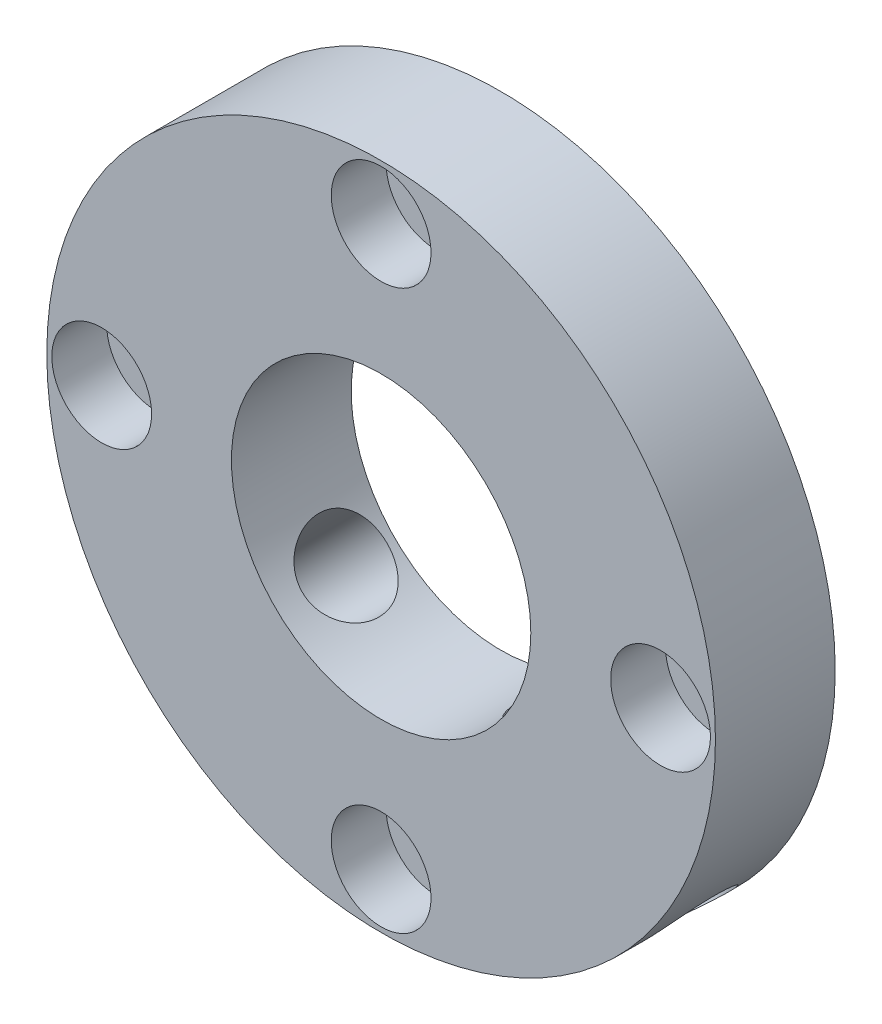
from build123d import *

# Parameters (mm, degrees)
SKETCH1_R                               = 33.5
SKETCH1_R_2                             = 15
BOSS_EXTRUDE1_DEPTH                     = 12
CBORE_FOR_M5_HEX_HEAD_BOLT1_D           = 5.5
CBORE_FOR_M5_HEX_HEAD_BOLT1_CBORE_D     = 10
CBORE_FOR_M5_HEX_HEAD_BOLT1_CBORE_DEPTH = 5.5
CIRPATTERN1_COUNT                       = 4
F_8_0MM_DOWEL_HOLE1_REACH               = 83.174
F_8_0MM_DOWEL_HOLE1_BORE_R              = 4.25
CIRPATTERN2_COUNT                       = 2
CIRPATTERN2_ANGLE                       = 90


with BuildPart() as part:
    # Sketch1 → Boss-Extrude1 (new body)
    with BuildSketch(Plane.XY):
        Circle(SKETCH1_R)
        Circle(SKETCH1_R_2, mode=Mode.SUBTRACT)
    extrude(amount=BOSS_EXTRUDE1_DEPTH)

    # CBORE for M5 Hex Head Bolt1 (through all)
    with Locations(Plane(origin=(0, 28, 12), x_dir=(1, 0, 0), z_dir=(0, 0, 1))):
        with Locations((0, 0)):
            cbore_for_m5_hex_head_bolt1 = CounterBoreHole(CBORE_FOR_M5_HEX_HEAD_BOLT1_D / 2, CBORE_FOR_M5_HEX_HEAD_BOLT1_CBORE_D / 2, CBORE_FOR_M5_HEX_HEAD_BOLT1_CBORE_DEPTH)

    # CirPattern1: CBORE for M5 Hex Head Bolt1 ×4 about axis
    cirpattern1_axis = Axis((0, 0, 0), (0, 0, 1))
    for i in range(1, CIRPATTERN1_COUNT):
        add(cbore_for_m5_hex_head_bolt1.rotate(cirpattern1_axis, i * 360 / CIRPATTERN1_COUNT), mode=Mode.SUBTRACT)

    # 8.0mm Dowel Hole1 bore (on position points) → 8.0mm Dowel Hole1 (cut, up to next)
    with BuildSketch(Plane(origin=(-23.68807717, -23.68807717, 5.05), x_dir=(0.707106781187, -0.707106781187, 0), z_dir=(-0.707106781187, -0.707106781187, 0)), mode=Mode.PRIVATE) as f_8_0mm_dowel_hole1_sk1:
        Circle(F_8_0MM_DOWEL_HOLE1_BORE_R)
    f_8_0mm_dowel_hole1_tool1 = extrude(f_8_0mm_dowel_hole1_sk1.sketch, amount=-F_8_0MM_DOWEL_HOLE1_REACH, mode=Mode.PRIVATE) & part.part
    f_8_0mm_dowel_hole1 = f_8_0mm_dowel_hole1_tool1.solids().sort_by_distance((-23.688077, -23.688077, 5.05))[0]
    add(f_8_0mm_dowel_hole1, mode=Mode.SUBTRACT)

    # CirPattern2: 8.0mm Dowel Hole1 ×2 about axis
    cirpattern2_axis = Axis((0, 0, 12), (0, 0, 1))
    for i in range(1, CIRPATTERN2_COUNT):
        add(f_8_0mm_dowel_hole1.rotate(cirpattern2_axis, i * CIRPATTERN2_ANGLE / (CIRPATTERN2_COUNT - 1)), mode=Mode.SUBTRACT)


solid = part.part
